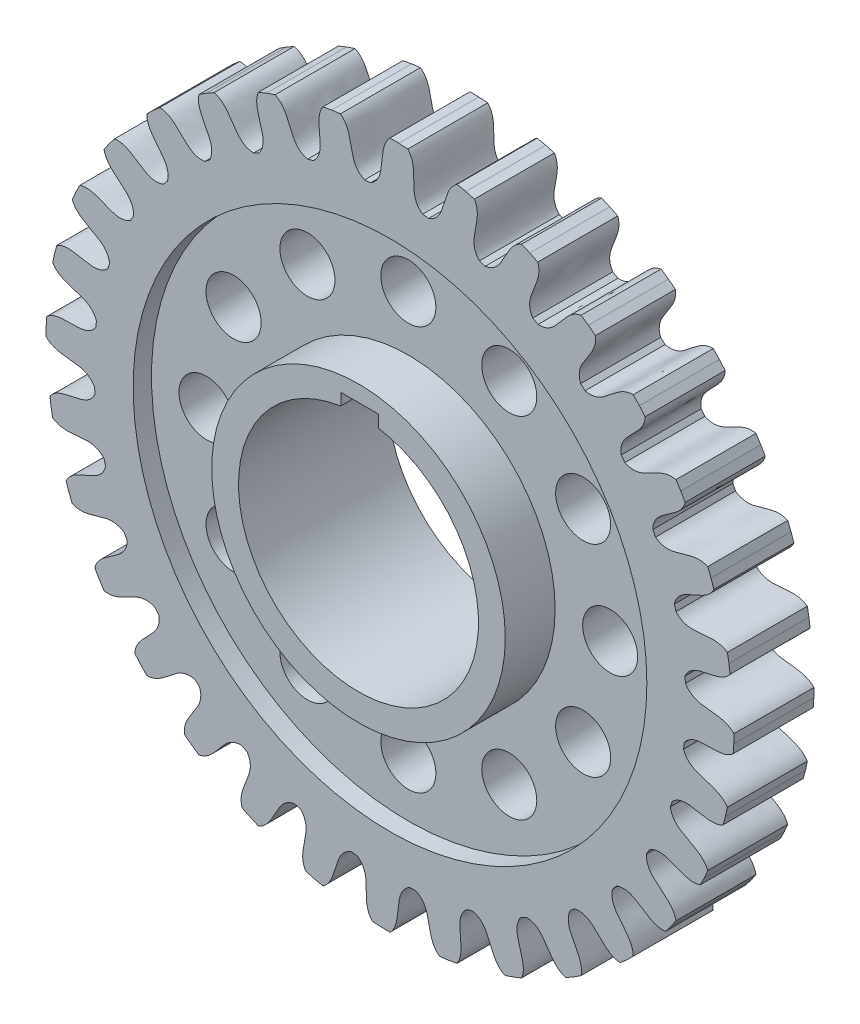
from build123d import *

# Parameters (mm, degrees)
AUFSATZ_LINEAR_AUSTRAGEN1_DEPTH = 13.081
SKIZZE2_R                       = 24
AUFSATZ_LINEAR_AUSTRAGEN2_DEPTH = 5.15
AUFSATZ_LINEAR_START            = 6.18
SKIZZE3_R                       = 24
AUFSATZ_LINEAR_AUSTRAGEN3_DEPTH = 6.18
SCHNITT_LINEAR_AUSTRAGEN1_DEPTH = 84.194484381
SKIZZE5_W                       = 19.6215
SKIZZE5_H                       = 24.411
SCHNITT_LINEAR_START            = -3
SKIZZE6_R                       = 42
SKIZZE6_R_2                     = 24
SCHNITT_LINEAR_AUSTRAGEN2_DEPTH = 3
SKIZZE10_R                      = 42.05
SKIZZE10_R_2                    = 24
SCHNITT_LINEAR_AUSTRAGEN6_DEPTH = 3
SKIZZE9_R                       = 4.5
SCHNITT_LINEAR_AUSTRAGEN5_DEPTH = 82.595310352


with BuildPart() as part:
    # Skizze1 → Aufsatz-Linear austragen1 (new body)
    with BuildSketch(Plane.XY.offset(13.081)):
        with BuildLine():
            Line((22.855064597, 51.384420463), (21.521350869, 51.957137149))
            add(Edge.make_bspline(
                [(15.55468588, 45.842991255), (18.896430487, 46.321686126), (18.613373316, 50.778897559), (21.521350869, 51.957137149)],
                knots=[0, 0, 0, 0, 1, 1, 1, 1], degree=3))
            ThreePointArc((15.55468588, 45.842991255), (15.090249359, 45.997961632), (14.624269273, 46.148226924))
            add(Edge.make_bspline(
                [(13.791563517, 54.473680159), (15.409186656, 51.825446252), (12.308759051, 48.516392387), (14.624269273, 46.148226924)],
                knots=[0, 0, 0, 0, 1, 1, 1, 1], degree=3))
            Line((13.791563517, 54.473680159), (12.391307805, 54.855885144))
            Line((12.391307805, 54.855885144), (10.97148953, 55.157402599))
            add(Edge.make_bspline(
                [(6.312283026, 47.996699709), (9.496428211, 49.118138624), (8.349251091, 53.434484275), (10.97148953, 55.157402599)],
                knots=[0, 0, 0, 0, 1, 1, 1, 1], degree=3))
            ThreePointArc((6.312283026, 47.996699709), (5.826537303, 48.058085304), (5.340195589, 48.114555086))
            add(Edge.make_bspline(
                [(2.899274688, 56.117584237), (5.002460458, 53.835818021), (2.607171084, 49.985483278), (5.340195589, 48.114555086)],
                knots=[0, 0, 0, 0, 1, 1, 1, 1], degree=3))
            Line((2.899274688, 56.117584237), (1.451360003, 56.219268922))
            Line((1.451360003, 56.219268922), (0, 56.238))
            add(Edge.make_bspline(
                [(-3.172697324, 48.305921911), (-0.268516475, 50.027008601), (-2.235728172, 54.036613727), (0, 56.238)],
                knots=[0, 0, 0, 0, 1, 1, 1, 1], degree=3))
            ThreePointArc((-3.172697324, 48.305921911), (-3.661085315, 48.271363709), (-4.149098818, 48.231867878))
            add(Edge.make_bspline(
                [(-8.104431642, 55.604921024), (-5.596507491, 53.777309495), (-7.194609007, 49.533660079), (-4.149098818, 48.231867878)],
                knots=[0, 0, 0, 0, 1, 1, 1, 1], degree=3))
            Line((-8.104431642, 55.604921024), (-9.54436275, 55.422177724))
            Line((-9.54436275, 55.422177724), (-10.97148953, 55.157402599))
            add(Edge.make_bspline(
                [(-12.535752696, 46.758774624), (-10.023142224, 49.013368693), (-12.734789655, 52.562146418), (-10.97148953, 55.157402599)],
                knots=[0, 0, 0, 0, 1, 1, 1, 1], degree=3))
            ThreePointArc((-12.535752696, 46.758774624), (-13.008014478, 46.629600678), (-13.478945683, 46.495657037))
            add(Edge.make_bspline(
                [(-18.796689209, 52.955391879), (-15.980404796, 51.652169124), (-16.719904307, 47.178286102), (-13.478945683, 46.495657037)],
                knots=[0, 0, 0, 0, 1, 1, 1, 1], degree=3))
            Line((-18.796689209, 52.955391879), (-20.173300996, 52.495243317))
            Line((-20.173300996, 52.495243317), (-21.521350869, 51.957137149))
            add(Edge.make_bspline(
                [(-21.417066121, 43.414713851), (-19.392584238, 46.116172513), (-22.744460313, 49.067745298), (-21.521350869, 51.957137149)],
                knots=[0, 0, 0, 0, 1, 1, 1, 1], degree=3))
            ThreePointArc((-21.417066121, 43.414713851), (-21.855052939, 43.195888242), (-22.290804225, 42.972644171))
            add(Edge.make_bspline(
                [(-28.766600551, 48.270816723), (-25.750184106, 47.54206486), (-25.602663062, 43.009877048), (-22.290804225, 42.972644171)],
                knots=[0, 0, 0, 0, 1, 1, 1, 1], degree=3))
            Line((-28.766600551, 48.270816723), (-30.026990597, 47.550946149))
            Line((-30.026990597, 47.550946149), (-31.244158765, 46.760188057))
            add(Edge.make_bspline(
                [(-29.475333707, 38.402249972), (-28.016780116, 41.446757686), (-31.880074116, 43.687698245), (-31.244158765, 46.760188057)],
                knots=[0, 0, 0, 0, 1, 1, 1, 1], degree=3))
            ThreePointArc((-29.475333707, 38.402249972), (-29.862213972, 38.102182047), (-30.246039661, 37.798216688))
            add(Edge.make_bspline(
                [(-37.631027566, 41.73122115), (-34.530398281, 41.604945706), (-33.501525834, 37.18862254), (-30.246039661, 37.798216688)],
                knots=[0, 0, 0, 0, 1, 1, 1, 1], degree=3))
            Line((-37.631027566, 41.73122115), (-38.726759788, 40.779292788))
            Line((-38.726759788, 40.779292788), (-39.76627116, 39.76627116))
            add(Edge.make_bspline(
                [(-36.400880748, 31.914009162), (-35.564306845, 35.184567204), (-39.79055455, 36.628757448), (-39.76627116, 39.76627116)],
                knots=[0, 0, 0, 0, 1, 1, 1, 1], degree=3))
            ThreePointArc((-36.400880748, 31.914009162), (-36.721786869, 31.544230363), (-37.038936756, 31.171224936))
            add(Edge.make_bspline(
                [(-45.049315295, 33.587918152), (-41.983628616, 34.06897182), (-40.112943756, 29.938230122), (-37.038936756, 31.171224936)],
                knots=[0, 0, 0, 0, 1, 1, 1, 1], degree=3))
            Line((-45.049315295, 33.587918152), (-45.93828132, 32.440514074))
            Line((-45.93828132, 32.440514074), (-46.760188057, 31.244158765))
            add(Edge.make_bspline(
                [(-41.927562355, 24.199330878), (-41.745117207, 27.570253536), (-46.171906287, 28.162194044), (-46.760188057, 31.244158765)],
                knots=[0, 0, 0, 0, 1, 1, 1, 1], degree=3))
            ThreePointArc((-41.927562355, 24.199330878), (-42.17016209, 23.774051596), (-42.408448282, 23.346340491))
            add(Edge.make_bspline(
                [(-50.736383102, 24.153850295), (-47.823451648, 25.223746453), (-45.182843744, 21.537328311), (-42.408448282, 23.346340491)],
                knots=[0, 0, 0, 0, 1, 1, 1, 1], degree=3))
            Line((-50.736383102, 24.153850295), (-51.384420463, 22.855064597))
            Line((-51.384420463, 22.855064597), (-51.957137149, 21.521350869))
            add(Edge.make_bspline(
                [(-45.842991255, 15.55468588), (-46.321686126, 18.896430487), (-50.778897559, 18.613373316), (-51.957137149, 21.521350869)],
                knots=[0, 0, 0, 0, 1, 1, 1, 1], degree=3))
            ThreePointArc((-45.842991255, 15.55468588), (-45.997961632, 15.090249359), (-46.148226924, 14.624269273))
            add(Edge.make_bspline(
                [(-54.473680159, 13.791563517), (-51.825446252, 15.409186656), (-48.516392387, 12.308759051), (-46.148226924, 14.624269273)],
                knots=[0, 0, 0, 0, 1, 1, 1, 1], degree=3))
            Line((-54.473680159, 13.791563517), (-54.855885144, 12.391307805))
            Line((-54.855885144, 12.391307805), (-55.157402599, 10.97148953))
            add(Edge.make_bspline(
                [(-47.996699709, 6.312283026), (-49.118138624, 9.496428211), (-53.434484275, 8.349251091), (-55.157402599, 10.97148953)],
                knots=[0, 0, 0, 0, 1, 1, 1, 1], degree=3))
            ThreePointArc((-47.996699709, 6.312283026), (-48.058085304, 5.826537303), (-48.114555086, 5.340195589))
            add(Edge.make_bspline(
                [(-56.117584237, 2.899274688), (-53.835818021, 5.002460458), (-49.985483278, 2.607171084), (-48.114555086, 5.340195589)],
                knots=[0, 0, 0, 0, 1, 1, 1, 1], degree=3))
            Line((-56.117584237, 2.899274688), (-56.219268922, 1.451360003))
            Line((-56.219268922, 1.451360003), (-56.238, 0))
            add(Edge.make_bspline(
                [(-48.305921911, -3.172697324), (-50.027008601, -0.268516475), (-54.036613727, -2.235728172), (-56.238, 0)],
                knots=[0, 0, 0, 0, 1, 1, 1, 1], degree=3))
            ThreePointArc((-48.305921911, -3.172697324), (-48.271363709, -3.661085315), (-48.231867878, -4.149098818))
            add(Edge.make_bspline(
                [(-55.604921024, -8.104431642), (-53.777309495, -5.596507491), (-49.533660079, -7.194609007), (-48.231867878, -4.149098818)],
                knots=[0, 0, 0, 0, 1, 1, 1, 1], degree=3))
            Line((-55.604921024, -8.104431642), (-55.422177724, -9.54436275))
            Line((-55.422177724, -9.54436275), (-55.157402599, -10.97148953))
            add(Edge.make_bspline(
                [(-46.758774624, -12.535752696), (-49.013368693, -10.023142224), (-52.562146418, -12.734789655), (-55.157402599, -10.97148953)],
                knots=[0, 0, 0, 0, 1, 1, 1, 1], degree=3))
            ThreePointArc((-46.758774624, -12.535752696), (-46.629600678, -13.008014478), (-46.495657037, -13.478945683))
            add(Edge.make_bspline(
                [(-52.955391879, -18.796689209), (-51.652169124, -15.980404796), (-47.178286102, -16.719904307), (-46.495657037, -13.478945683)],
                knots=[0, 0, 0, 0, 1, 1, 1, 1], degree=3))
            Line((-52.955391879, -18.796689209), (-52.495243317, -20.173300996))
            Line((-52.495243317, -20.173300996), (-51.957137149, -21.521350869))
            add(Edge.make_bspline(
                [(-43.414713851, -21.417066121), (-46.116172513, -19.392584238), (-49.067745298, -22.744460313), (-51.957137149, -21.521350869)],
                knots=[0, 0, 0, 0, 1, 1, 1, 1], degree=3))
            ThreePointArc((-43.414713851, -21.417066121), (-43.195888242, -21.855052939), (-42.972644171, -22.290804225))
            add(Edge.make_bspline(
                [(-48.270816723, -28.766600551), (-47.54206486, -25.750184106), (-43.009877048, -25.602663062), (-42.972644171, -22.290804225)],
                knots=[0, 0, 0, 0, 1, 1, 1, 1], degree=3))
            Line((-48.270816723, -28.766600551), (-47.550946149, -30.026990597))
            Line((-47.550946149, -30.026990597), (-46.760188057, -31.244158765))
            add(Edge.make_bspline(
                [(-38.402249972, -29.475333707), (-41.446757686, -28.016780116), (-43.687698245, -31.880074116), (-46.760188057, -31.244158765)],
                knots=[0, 0, 0, 0, 1, 1, 1, 1], degree=3))
            ThreePointArc((-38.402249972, -29.475333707), (-38.102182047, -29.862213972), (-37.798216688, -30.246039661))
            add(Edge.make_bspline(
                [(-41.73122115, -37.631027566), (-41.604945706, -34.530398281), (-37.18862254, -33.501525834), (-37.798216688, -30.246039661)],
                knots=[0, 0, 0, 0, 1, 1, 1, 1], degree=3))
            Line((-41.73122115, -37.631027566), (-40.779292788, -38.726759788))
            Line((-40.779292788, -38.726759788), (-39.76627116, -39.76627116))
            add(Edge.make_bspline(
                [(-31.914009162, -36.400880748), (-35.184567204, -35.564306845), (-36.628757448, -39.79055455), (-39.76627116, -39.76627116)],
                knots=[0, 0, 0, 0, 1, 1, 1, 1], degree=3))
            ThreePointArc((-31.914009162, -36.400880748), (-31.544230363, -36.721786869), (-31.171224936, -37.038936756))
            add(Edge.make_bspline(
                [(-33.587918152, -45.049315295), (-34.06897182, -41.983628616), (-29.938230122, -40.112943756), (-31.171224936, -37.038936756)],
                knots=[0, 0, 0, 0, 1, 1, 1, 1], degree=3))
            Line((-33.587918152, -45.049315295), (-32.440514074, -45.93828132))
            Line((-32.440514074, -45.93828132), (-31.244158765, -46.760188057))
            add(Edge.make_bspline(
                [(-24.199330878, -41.927562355), (-27.570253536, -41.745117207), (-28.162194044, -46.171906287), (-31.244158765, -46.760188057)],
                knots=[0, 0, 0, 0, 1, 1, 1, 1], degree=3))
            ThreePointArc((-24.199330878, -41.927562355), (-23.774051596, -42.17016209), (-23.346340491, -42.408448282))
            add(Edge.make_bspline(
                [(-24.153850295, -50.736383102), (-25.223746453, -47.823451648), (-21.537328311, -45.182843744), (-23.346340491, -42.408448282)],
                knots=[0, 0, 0, 0, 1, 1, 1, 1], degree=3))
            Line((-24.153850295, -50.736383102), (-22.855064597, -51.384420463))
            Line((-22.855064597, -51.384420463), (-21.521350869, -51.957137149))
            add(Edge.make_bspline(
                [(-15.55468588, -45.842991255), (-18.896430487, -46.321686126), (-18.613373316, -50.778897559), (-21.521350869, -51.957137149)],
                knots=[0, 0, 0, 0, 1, 1, 1, 1], degree=3))
            ThreePointArc((-15.55468588, -45.842991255), (-15.090249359, -45.997961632), (-14.624269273, -46.148226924))
            add(Edge.make_bspline(
                [(-13.791563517, -54.473680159), (-15.409186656, -51.825446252), (-12.308759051, -48.516392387), (-14.624269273, -46.148226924)],
                knots=[0, 0, 0, 0, 1, 1, 1, 1], degree=3))
            Line((-13.791563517, -54.473680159), (-12.391307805, -54.855885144))
            Line((-12.391307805, -54.855885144), (-10.97148953, -55.157402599))
            add(Edge.make_bspline(
                [(-6.312283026, -47.996699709), (-9.496428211, -49.118138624), (-8.349251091, -53.434484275), (-10.97148953, -55.157402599)],
                knots=[0, 0, 0, 0, 1, 1, 1, 1], degree=3))
            ThreePointArc((-6.312283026, -47.996699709), (-5.826537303, -48.058085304), (-5.340195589, -48.114555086))
            add(Edge.make_bspline(
                [(-2.899274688, -56.117584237), (-5.002460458, -53.835818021), (-2.607171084, -49.985483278), (-5.340195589, -48.114555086)],
                knots=[0, 0, 0, 0, 1, 1, 1, 1], degree=3))
            Line((-2.899274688, -56.117584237), (-1.451360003, -56.219268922))
            Line((-1.451360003, -56.219268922), (0, -56.238))
            add(Edge.make_bspline(
                [(3.172697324, -48.305921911), (0.268516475, -50.027008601), (2.235728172, -54.036613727), (0, -56.238)],
                knots=[0, 0, 0, 0, 1, 1, 1, 1], degree=3))
            ThreePointArc((3.172697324, -48.305921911), (3.661085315, -48.271363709), (4.149098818, -48.231867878))
            add(Edge.make_bspline(
                [(8.104431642, -55.604921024), (5.596507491, -53.777309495), (7.194609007, -49.533660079), (4.149098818, -48.231867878)],
                knots=[0, 0, 0, 0, 1, 1, 1, 1], degree=3))
            Line((8.104431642, -55.604921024), (9.54436275, -55.422177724))
            Line((9.54436275, -55.422177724), (10.97148953, -55.157402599))
            add(Edge.make_bspline(
                [(12.535752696, -46.758774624), (10.023142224, -49.013368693), (12.734789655, -52.562146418), (10.97148953, -55.157402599)],
                knots=[0, 0, 0, 0, 1, 1, 1, 1], degree=3))
            ThreePointArc((12.535752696, -46.758774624), (13.008014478, -46.629600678), (13.478945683, -46.495657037))
            add(Edge.make_bspline(
                [(18.796689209, -52.955391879), (15.980404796, -51.652169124), (16.719904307, -47.178286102), (13.478945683, -46.495657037)],
                knots=[0, 0, 0, 0, 1, 1, 1, 1], degree=3))
            Line((18.796689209, -52.955391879), (20.173300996, -52.495243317))
            Line((20.173300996, -52.495243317), (21.521350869, -51.957137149))
            add(Edge.make_bspline(
                [(21.417066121, -43.414713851), (19.392584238, -46.116172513), (22.744460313, -49.067745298), (21.521350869, -51.957137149)],
                knots=[0, 0, 0, 0, 1, 1, 1, 1], degree=3))
            ThreePointArc((21.417066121, -43.414713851), (21.855052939, -43.195888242), (22.290804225, -42.972644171))
            add(Edge.make_bspline(
                [(28.766600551, -48.270816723), (25.750184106, -47.54206486), (25.602663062, -43.009877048), (22.290804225, -42.972644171)],
                knots=[0, 0, 0, 0, 1, 1, 1, 1], degree=3))
            Line((28.766600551, -48.270816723), (30.026990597, -47.550946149))
            Line((30.026990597, -47.550946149), (31.244158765, -46.760188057))
            add(Edge.make_bspline(
                [(29.475333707, -38.402249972), (28.016780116, -41.446757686), (31.880074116, -43.687698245), (31.244158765, -46.760188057)],
                knots=[0, 0, 0, 0, 1, 1, 1, 1], degree=3))
            ThreePointArc((29.475333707, -38.402249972), (29.862213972, -38.102182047), (30.246039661, -37.798216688))
            add(Edge.make_bspline(
                [(37.631027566, -41.73122115), (34.530398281, -41.604945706), (33.501525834, -37.18862254), (30.246039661, -37.798216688)],
                knots=[0, 0, 0, 0, 1, 1, 1, 1], degree=3))
            Line((37.631027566, -41.73122115), (38.726759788, -40.779292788))
            Line((38.726759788, -40.779292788), (39.76627116, -39.76627116))
            add(Edge.make_bspline(
                [(36.400880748, -31.914009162), (35.564306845, -35.184567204), (39.79055455, -36.628757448), (39.76627116, -39.76627116)],
                knots=[0, 0, 0, 0, 1, 1, 1, 1], degree=3))
            ThreePointArc((36.400880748, -31.914009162), (36.721786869, -31.544230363), (37.038936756, -31.171224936))
            add(Edge.make_bspline(
                [(45.049315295, -33.587918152), (41.983628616, -34.06897182), (40.112943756, -29.938230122), (37.038936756, -31.171224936)],
                knots=[0, 0, 0, 0, 1, 1, 1, 1], degree=3))
            Line((45.049315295, -33.587918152), (45.93828132, -32.440514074))
            Line((45.93828132, -32.440514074), (46.760188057, -31.244158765))
            add(Edge.make_bspline(
                [(41.927562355, -24.199330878), (41.745117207, -27.570253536), (46.171906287, -28.162194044), (46.760188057, -31.244158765)],
                knots=[0, 0, 0, 0, 1, 1, 1, 1], degree=3))
            ThreePointArc((41.927562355, -24.199330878), (42.17016209, -23.774051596), (42.408448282, -23.346340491))
            add(Edge.make_bspline(
                [(50.736383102, -24.153850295), (47.823451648, -25.223746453), (45.182843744, -21.537328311), (42.408448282, -23.346340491)],
                knots=[0, 0, 0, 0, 1, 1, 1, 1], degree=3))
            Line((50.736383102, -24.153850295), (51.384420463, -22.855064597))
            Line((51.384420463, -22.855064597), (51.957137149, -21.521350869))
            add(Edge.make_bspline(
                [(45.842991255, -15.55468588), (46.321686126, -18.896430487), (50.778897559, -18.613373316), (51.957137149, -21.521350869)],
                knots=[0, 0, 0, 0, 1, 1, 1, 1], degree=3))
            ThreePointArc((45.842991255, -15.55468588), (45.997961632, -15.090249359), (46.148226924, -14.624269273))
            add(Edge.make_bspline(
                [(54.473680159, -13.791563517), (51.825446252, -15.409186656), (48.516392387, -12.308759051), (46.148226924, -14.624269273)],
                knots=[0, 0, 0, 0, 1, 1, 1, 1], degree=3))
            Line((54.473680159, -13.791563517), (54.855885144, -12.391307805))
            Line((54.855885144, -12.391307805), (55.157402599, -10.97148953))
            add(Edge.make_bspline(
                [(47.996699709, -6.312283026), (49.118138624, -9.496428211), (53.434484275, -8.349251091), (55.157402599, -10.97148953)],
                knots=[0, 0, 0, 0, 1, 1, 1, 1], degree=3))
            ThreePointArc((47.996699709, -6.312283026), (48.058085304, -5.826537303), (48.114555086, -5.340195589))
            add(Edge.make_bspline(
                [(56.117584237, -2.899274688), (53.835818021, -5.002460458), (49.985483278, -2.607171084), (48.114555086, -5.340195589)],
                knots=[0, 0, 0, 0, 1, 1, 1, 1], degree=3))
            Line((56.117584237, -2.899274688), (56.219268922, -1.451360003))
            Line((56.219268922, -1.451360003), (56.238, 0))
            add(Edge.make_bspline(
                [(48.305921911, 3.172697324), (50.027008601, 0.268516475), (54.036613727, 2.235728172), (56.238, 0)],
                knots=[0, 0, 0, 0, 1, 1, 1, 1], degree=3))
            ThreePointArc((48.305921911, 3.172697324), (48.271363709, 3.661085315), (48.231867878, 4.149098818))
            add(Edge.make_bspline(
                [(55.604921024, 8.104431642), (53.777309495, 5.596507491), (49.533660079, 7.194609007), (48.231867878, 4.149098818)],
                knots=[0, 0, 0, 0, 1, 1, 1, 1], degree=3))
            Line((55.604921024, 8.104431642), (55.422177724, 9.54436275))
            Line((55.422177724, 9.54436275), (55.157402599, 10.97148953))
            add(Edge.make_bspline(
                [(46.758774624, 12.535752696), (49.013368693, 10.023142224), (52.562146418, 12.734789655), (55.157402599, 10.97148953)],
                knots=[0, 0, 0, 0, 1, 1, 1, 1], degree=3))
            ThreePointArc((46.758774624, 12.535752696), (46.629600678, 13.008014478), (46.495657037, 13.478945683))
            add(Edge.make_bspline(
                [(52.955391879, 18.796689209), (51.652169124, 15.980404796), (47.178286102, 16.719904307), (46.495657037, 13.478945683)],
                knots=[0, 0, 0, 0, 1, 1, 1, 1], degree=3))
            Line((52.955391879, 18.796689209), (52.495243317, 20.173300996))
            Line((52.495243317, 20.173300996), (51.957137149, 21.521350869))
            add(Edge.make_bspline(
                [(43.414713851, 21.417066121), (46.116172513, 19.392584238), (49.067745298, 22.744460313), (51.957137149, 21.521350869)],
                knots=[0, 0, 0, 0, 1, 1, 1, 1], degree=3))
            ThreePointArc((43.414713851, 21.417066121), (43.195888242, 21.855052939), (42.972644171, 22.290804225))
            add(Edge.make_bspline(
                [(48.270816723, 28.766600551), (47.54206486, 25.750184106), (43.009877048, 25.602663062), (42.972644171, 22.290804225)],
                knots=[0, 0, 0, 0, 1, 1, 1, 1], degree=3))
            Line((48.270816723, 28.766600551), (47.550946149, 30.026990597))
            Line((47.550946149, 30.026990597), (46.760188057, 31.244158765))
            add(Edge.make_bspline(
                [(38.402249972, 29.475333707), (41.446757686, 28.016780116), (43.687698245, 31.880074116), (46.760188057, 31.244158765)],
                knots=[0, 0, 0, 0, 1, 1, 1, 1], degree=3))
            ThreePointArc((38.402249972, 29.475333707), (38.102182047, 29.862213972), (37.798216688, 30.246039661))
            add(Edge.make_bspline(
                [(41.73122115, 37.631027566), (41.604945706, 34.530398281), (37.18862254, 33.501525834), (37.798216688, 30.246039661)],
                knots=[0, 0, 0, 0, 1, 1, 1, 1], degree=3))
            Line((41.73122115, 37.631027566), (40.779292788, 38.726759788))
            Line((40.779292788, 38.726759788), (39.76627116, 39.76627116))
            add(Edge.make_bspline(
                [(31.914009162, 36.400880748), (35.184567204, 35.564306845), (36.628757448, 39.79055455), (39.76627116, 39.76627116)],
                knots=[0, 0, 0, 0, 1, 1, 1, 1], degree=3))
            ThreePointArc((31.914009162, 36.400880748), (31.544230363, 36.721786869), (31.171224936, 37.038936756))
            add(Edge.make_bspline(
                [(33.587918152, 45.049315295), (34.06897182, 41.983628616), (29.938230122, 40.112943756), (31.171224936, 37.038936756)],
                knots=[0, 0, 0, 0, 1, 1, 1, 1], degree=3))
            Line((33.587918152, 45.049315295), (32.440514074, 45.93828132))
            Line((32.440514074, 45.93828132), (31.244158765, 46.760188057))
            add(Edge.make_bspline(
                [(24.199330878, 41.927562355), (27.570253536, 41.745117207), (28.162194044, 46.171906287), (31.244158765, 46.760188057)],
                knots=[0, 0, 0, 0, 1, 1, 1, 1], degree=3))
            ThreePointArc((24.199330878, 41.927562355), (23.774051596, 42.17016209), (23.346340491, 42.408448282))
            add(Edge.make_bspline(
                [(24.153850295, 50.736383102), (25.223746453, 47.823451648), (21.537328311, 45.182843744), (23.346340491, 42.408448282)],
                knots=[0, 0, 0, 0, 1, 1, 1, 1], degree=3))
            Line((24.153850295, 50.736383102), (22.855064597, 51.384420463))
        make_face()
    extrude(amount=-AUFSATZ_LINEAR_AUSTRAGEN1_DEPTH)

    # Skizze2 → Aufsatz-Linear austragen2 (add)
    with BuildSketch(Plane.XY.offset(13.081)):
        with Locations(Location((0, 0, 0), (0, 0, 180))):
            Circle(SKIZZE2_R)
    extrude(amount=AUFSATZ_LINEAR_AUSTRAGEN2_DEPTH)

    # Skizze3 → Aufsatz-Linear austragen3 (add)
    with BuildSketch(Plane(origin=(0, 0, 0), x_dir=(-1, 0, 0), z_dir=(0, 0, -1)).offset(AUFSATZ_LINEAR_START)):
        Circle(SKIZZE3_R)
    extrude(amount=-AUFSATZ_LINEAR_AUSTRAGEN3_DEPTH)

    # Skizze4 → Schnitt-Linear austragen1 (cut, through all)
    with BuildSketch(Plane(origin=(0, 0, -6.18), x_dir=(-1, 0, 0), z_dir=(0, 0, -1))):
        with BuildLine():
            Line((2.897984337, 21.345067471), (-3.282015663, 21.345067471))
            Line((-3.282015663, 21.345067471), (-3.282015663, 19.345067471))
            ThreePointArc((-3.282015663, 19.345067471), (-0.194442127, 19.62053655), (2.897984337, 19.406312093))
            Line((2.897984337, 19.406312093), (2.897984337, 21.345067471))
        make_face()
    extrude(amount=-SCHNITT_LINEAR_AUSTRAGEN1_DEPTH, mode=Mode.SUBTRACT)

    # Skizze5 → Schnitt-Rotation1 (revolve, cut)
    with BuildSketch(Plane(origin=(0, 0, 0), x_dir=(1, 0, 0), z_dir=(0, 1, 0))):
        with Locations((9.81075, -6.0255)):
            Rectangle(SKIZZE5_W, SKIZZE5_H)
    revolve(axis=Axis((0, 0, -6.18), (0, 0, 1)), mode=Mode.SUBTRACT)

    # Skizze6 → Schnitt-Linear austragen2 (cut)
    with BuildSketch(Plane.XY.offset(13.081).offset(SCHNITT_LINEAR_START)):
        Circle(SKIZZE6_R)
        Circle(SKIZZE6_R_2, mode=Mode.SUBTRACT)
    extrude(amount=SCHNITT_LINEAR_AUSTRAGEN2_DEPTH, mode=Mode.SUBTRACT)

    # Skizze10 → Schnitt-Linear austragen6 (cut)
    with BuildSketch(Plane(origin=(0, 0, 0), x_dir=(-1, 0, 0), z_dir=(0, 0, -1))):
        Circle(SKIZZE10_R)
        with Locations(Location((0, 0, 0), (0, 0, 180))):
            Circle(SKIZZE10_R_2, mode=Mode.SUBTRACT)
    extrude(amount=-SCHNITT_LINEAR_AUSTRAGEN6_DEPTH, mode=Mode.SUBTRACT)

    # Skizze9 → Schnitt-Linear austragen5 (cut, through all)
    with BuildSketch(Plane(origin=(0, 0, 0), x_dir=(-1, 0, 0), z_dir=(0, 0, -1))):
        with Locations((0, 33)):
            Circle(SKIZZE9_R)
        with Locations((16.5, 28.578838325)):
            Circle(SKIZZE9_R)
        with Locations((28.578838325, 16.5)):
            Circle(SKIZZE9_R)
        with Locations((33, 0)):
            Circle(SKIZZE9_R)
        with Locations((28.578838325, -16.5)):
            Circle(SKIZZE9_R)
        with Locations((16.5, -28.578838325)):
            Circle(SKIZZE9_R)
        with Locations((0, -33)):
            Circle(SKIZZE9_R)
        with Locations((-16.5, -28.578838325)):
            Circle(SKIZZE9_R)
        with Locations((-28.578838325, -16.5)):
            Circle(SKIZZE9_R)
        with Locations((-33, 0)):
            Circle(SKIZZE9_R)
        with Locations((-28.578838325, 16.5)):
            Circle(SKIZZE9_R)
        with Locations((-16.5, 28.578838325)):
            Circle(SKIZZE9_R)
    extrude(amount=-SCHNITT_LINEAR_AUSTRAGEN5_DEPTH, mode=Mode.SUBTRACT)


solid = part.part
